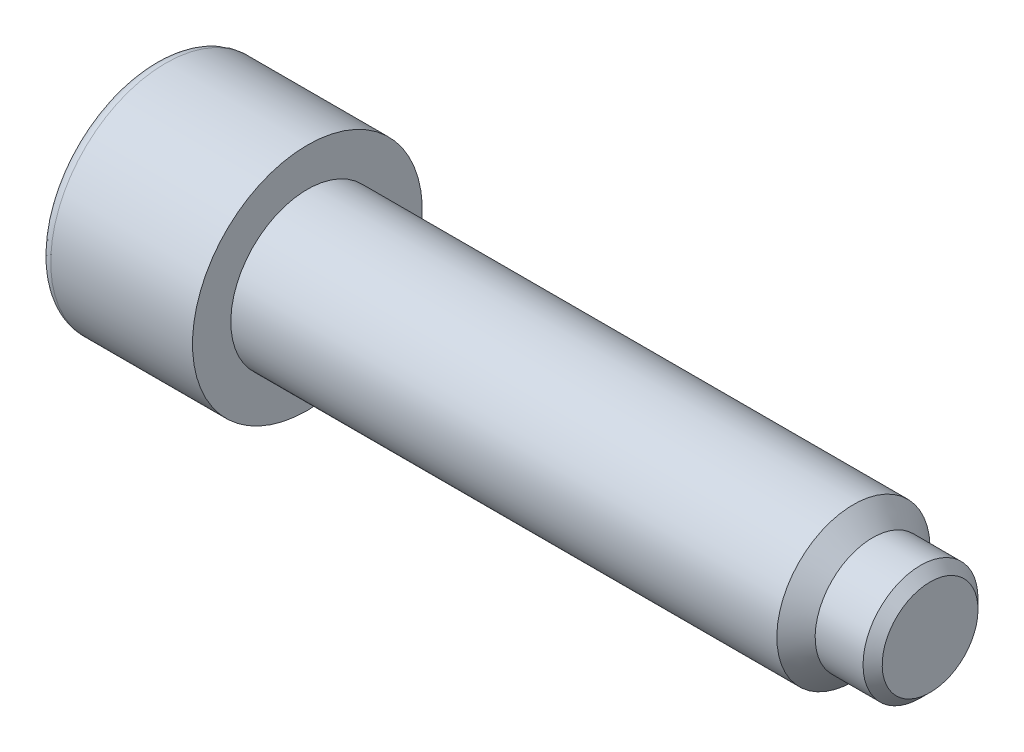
from build123d import *

# Parameters (mm, degrees)
EMPREINTE_CHC_DEPTH = 8
CHANFREIN1_SIZE     = 1
CONG_1_R            = 1.2


with BuildPart() as part:
    # Esquisse1 → R_volution1 (revolve)
    with BuildSketch(Plane(origin=(0, 0, 0), x_dir=(-1, 0, 0), z_dir=(0, 0, -1)), mode=Mode.PRIVATE) as r_volution1_sk:
        Polygon((-91, 6), (-91, 0), (-10, 0), (-10, 12), (-26, 12), (-26, 8), (-83, 8), (-85, 6), align=None)
    revolve(r_volution1_sk.sketch.rotate(Axis((91, 0, 0), (-1, 0, 0)), 180), axis=Axis((91, 0, 0), (-1, 0, 0)))

    # Esquisse2 → Empreinte CHc (cut)
    with BuildSketch(Plane.ZY.offset(-10)):
        Polygon((-7, -4.041451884), (0, -8.082903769), (7, -4.041451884), (7, 4.041451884), (0, 8.082903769), (-7, 4.041451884), align=None)
    extrude(amount=-EMPREINTE_CHC_DEPTH, mode=Mode.SUBTRACT)

    # Chanfrein1
    chanfrein1_edges = [part.edges().sort_by_distance(p)[0] for p in [
        (91, 6, 0),
    ]]
    chamfer(chanfrein1_edges, length=CHANFREIN1_SIZE)

    # Cong_1
    cong_1_edges = [part.edges().sort_by_distance(p)[0] for p in [
        (10, 12, 0),
    ]]
    fillet(cong_1_edges, radius=CONG_1_R)


solid = part.part
